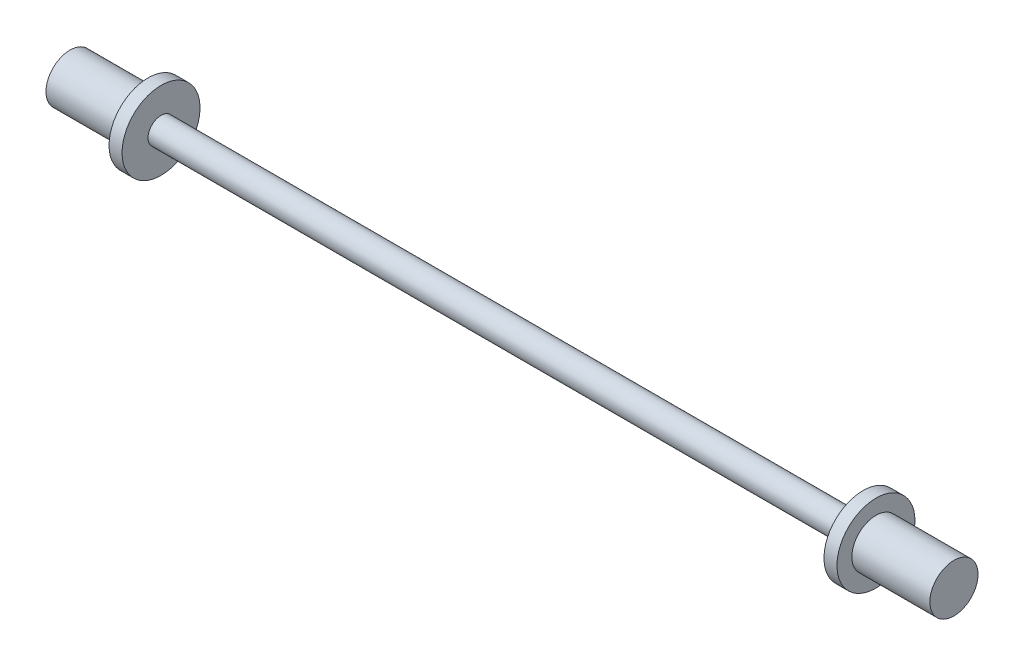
from build123d import *

# Parameters (mm, degrees)
BOSS_EXTRUDE1_DEPTH      = 171.45
BOSS_EXTRUDE1_DEPTH_BACK = 171.45
SKETCH2_R                = 6.35
SKETCH3_R                = 19.05
BOSS_EXTRUDE2_DEPTH      = 6.35
BOSS_EXTRUDE4_START      = 6.35
SKETCH7_R                = 19.05
BOSS_EXTRUDE4_DEPTH      = 6.35
SKETCH9_R                = 11.77
BOSS_EXTRUDE6_DEPTH      = 38.1
BOSS_EXTRUDE7_START      = 38.1
SKETCH10_R               = 11.77
BOSS_EXTRUDE7_DEPTH      = 38.1


with BuildPart() as part:
    # Sketch2 → Boss-Extrude1 (new, two sides: drawn at the far end of the back side and taken through both)
    with BuildSketch(Plane(origin=(0, 0, 0), x_dir=(0, 0, -1), z_dir=(1, 0, 0)).offset(-BOSS_EXTRUDE1_DEPTH_BACK)):
        Circle(SKETCH2_R)
    extrude(amount=BOSS_EXTRUDE1_DEPTH + BOSS_EXTRUDE1_DEPTH_BACK)

    # Sketch3 → Boss-Extrude2 (add)
    with BuildSketch(Plane(origin=(171.45, 0, 0), x_dir=(0, 0, -1), z_dir=(1, 0, 0))):
        Circle(SKETCH3_R)
    extrude(amount=BOSS_EXTRUDE2_DEPTH)

    # Sketch7 → Boss-Extrude4 (add)
    with BuildSketch(Plane.ZY.offset(171.45).offset(BOSS_EXTRUDE4_START)):
        with Locations(Location((0, 0, 0), (0, 0, 180))):
            Circle(SKETCH7_R)
    extrude(amount=-BOSS_EXTRUDE4_DEPTH)

    # Sketch9 → Boss-Extrude6 (add)
    with BuildSketch(Plane.ZY.offset(177.8)):
        with Locations(Location((0, 0, 0), (0, 0, 180))):
            Circle(SKETCH9_R)
    extrude(amount=BOSS_EXTRUDE6_DEPTH)

    # Sketch10 → Boss-Extrude7 (add)
    with BuildSketch(Plane(origin=(177.8, 0, 0), x_dir=(0, 0, -1), z_dir=(1, 0, 0)).offset(BOSS_EXTRUDE7_START)):
        Circle(SKETCH10_R)
    extrude(amount=-BOSS_EXTRUDE7_DEPTH)


solid = part.part
